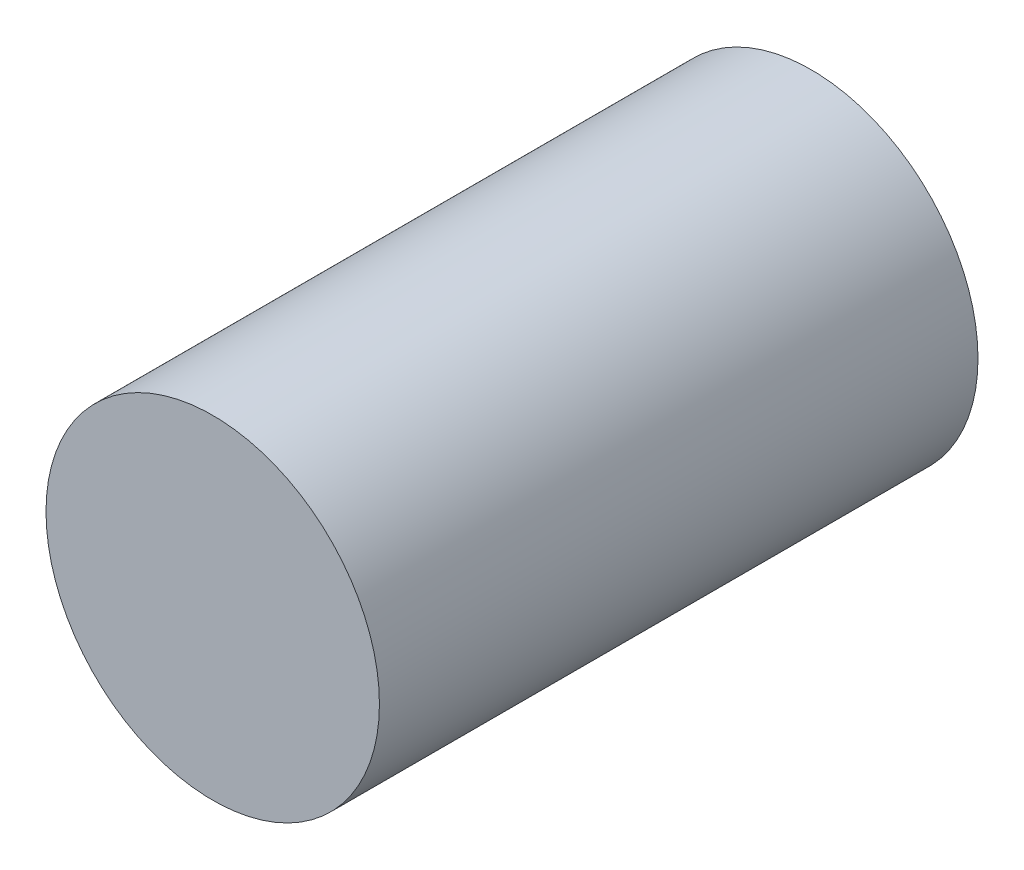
from build123d import *

# Parameters (mm, degrees)
SKETCH1_R           = 5.207
BOSS_EXTRUDE1_DEPTH = 18.6944


with BuildPart() as part:
    # Sketch1 → Boss-Extrude1 (new body)
    with BuildSketch(Plane.XY):
        Circle(SKETCH1_R)
    extrude(amount=BOSS_EXTRUDE1_DEPTH)


solid = part.part
